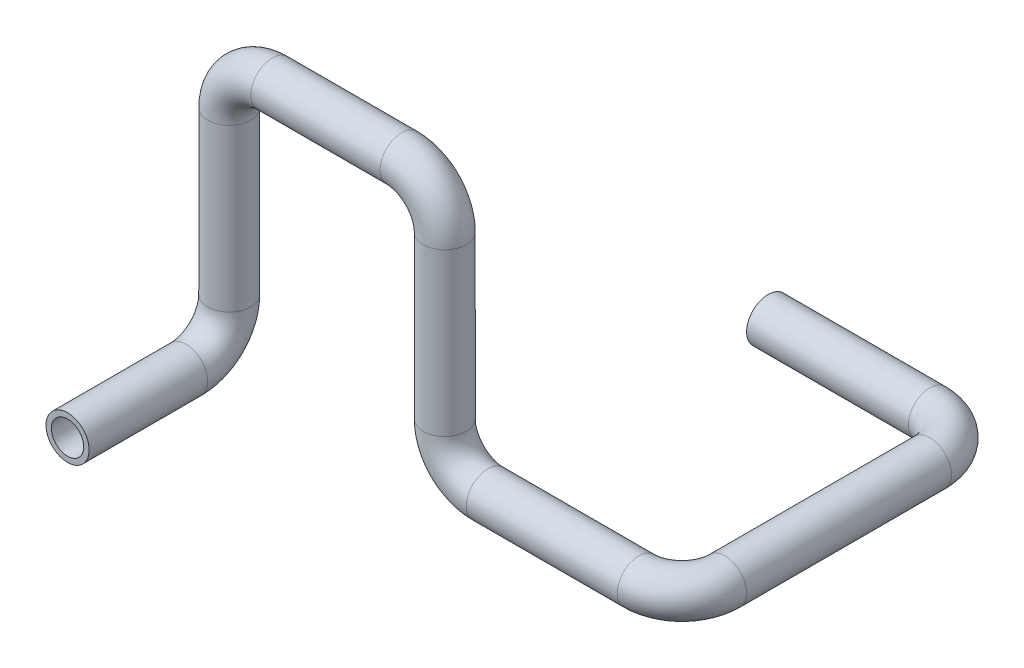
ISO-10303-21;
HEADER;
FILE_DESCRIPTION(('STEP AP214'),'2;1');
FILE_NAME('part.step','',(''),(''),'','','');
FILE_SCHEMA(('AUTOMOTIVE_DESIGN { 1 0 10303 214 1 1 1 1 }'));
ENDSEC;
DATA;
#1=APPLICATION_CONTEXT('core data for automotive mechanical design processes');
#2=APPLICATION_PROTOCOL_DEFINITION('international standard','automotive_design',2000,#1);
#3=PRODUCT_CONTEXT('',#1,'mechanical');
#4=PRODUCT('Part','Part','',(#3));
#5=PRODUCT_RELATED_PRODUCT_CATEGORY('part','',(#4));
#6=PRODUCT_DEFINITION_FORMATION('','',#4);
#7=PRODUCT_DEFINITION_CONTEXT('part definition',#1,'design');
#8=PRODUCT_DEFINITION('design','',#6,#7);
#9=PRODUCT_DEFINITION_SHAPE('','',#8);
#10=(LENGTH_UNIT() NAMED_UNIT(*) SI_UNIT(.MILLI.,.METRE.));
#11=(NAMED_UNIT(*) PLANE_ANGLE_UNIT() SI_UNIT($,.RADIAN.));
#12=(NAMED_UNIT(*) SI_UNIT($,.STERADIAN.) SOLID_ANGLE_UNIT());
#13=UNCERTAINTY_MEASURE_WITH_UNIT(LENGTH_MEASURE(1.E-05),#10,'distance_accuracy_value','');
#14=(GEOMETRIC_REPRESENTATION_CONTEXT(3) GLOBAL_UNCERTAINTY_ASSIGNED_CONTEXT((#13)) GLOBAL_UNIT_ASSIGNED_CONTEXT((#10,
#11,#12)) REPRESENTATION_CONTEXT('',''));
#15=CARTESIAN_POINT('',(0.,0.,0.));
#16=DIRECTION('',(0.,0.,1.));
#17=DIRECTION('',(1.,0.,0.));
#18=AXIS2_PLACEMENT_3D('',#15,#16,#17);
#19=CARTESIAN_POINT('',(0.,0.,0.));
#20=DIRECTION('',(-1.,0.,0.));
#21=DIRECTION('',(0.,1.,0.));
#22=AXIS2_PLACEMENT_3D('',#19,#20,#21);
#23=PLANE('',#22);
#24=CARTESIAN_POINT('',(0.,0.,0.));
#25=DIRECTION('',(-1.,0.,0.));
#26=DIRECTION('',(0.,0.,1.));
#27=AXIS2_PLACEMENT_3D('',#24,#25,#26);
#28=CIRCLE('',#27,7.49999999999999);
#29=CARTESIAN_POINT('',(0.,0.,7.49999999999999));
#30=VERTEX_POINT('',#29);
#31=EDGE_CURVE('E95',#30,#30,#28,.T.);
#32=ORIENTED_EDGE('',*,*,#31,.F.);
#33=EDGE_LOOP('',(#32));
#34=FACE_BOUND('',#33,.T.);
#35=CARTESIAN_POINT('',(0.,0.,0.));
#36=DIRECTION('',(-1.,0.,0.));
#37=DIRECTION('',(0.,1.,0.));
#38=AXIS2_PLACEMENT_3D('',#35,#36,#37);
#39=CIRCLE('',#38,9.99999999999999);
#40=CARTESIAN_POINT('',(0.,9.99999999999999,0.));
#41=VERTEX_POINT('',#40);
#42=EDGE_CURVE('E88',#41,#41,#39,.T.);
#43=ORIENTED_EDGE('',*,*,#42,.T.);
#44=EDGE_LOOP('',(#43));
#45=FACE_BOUND('',#44,.T.);
#46=ADVANCED_FACE('F42',(#34,#45),#23,.T.);
#47=CARTESIAN_POINT('',(-115.,0.,210.));
#48=DIRECTION('',(0.,0.,-1.));
#49=DIRECTION('',(-1.,0.,0.));
#50=AXIS2_PLACEMENT_3D('',#47,#48,#49);
#51=PLANE('',#50);
#52=CARTESIAN_POINT('',(-115.,0.,210.));
#53=DIRECTION('',(0.,0.,-1.));
#54=DIRECTION('',(-1.,0.,0.));
#55=AXIS2_PLACEMENT_3D('',#52,#53,#54);
#56=CIRCLE('',#55,7.49999999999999);
#57=CARTESIAN_POINT('',(-122.5,0.,210.));
#58=VERTEX_POINT('',#57);
#59=EDGE_CURVE('E91',#58,#58,#56,.T.);
#60=ORIENTED_EDGE('',*,*,#59,.T.);
#61=EDGE_LOOP('',(#60));
#62=FACE_BOUND('',#61,.T.);
#63=CARTESIAN_POINT('',(-115.,0.,210.));
#64=DIRECTION('',(0.,0.,-1.));
#65=DIRECTION('',(-1.,0.,0.));
#66=AXIS2_PLACEMENT_3D('',#63,#64,#65);
#67=CIRCLE('',#66,9.99999999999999);
#68=CARTESIAN_POINT('',(-125.,0.,210.));
#69=VERTEX_POINT('',#68);
#70=EDGE_CURVE('E11',#69,#69,#67,.T.);
#71=ORIENTED_EDGE('',*,*,#70,.F.);
#72=EDGE_LOOP('',(#71));
#73=FACE_BOUND('',#72,.T.);
#74=ADVANCED_FACE('F145',(#62,#73),#51,.F.);
#75=CARTESIAN_POINT('',(0.,0.,0.));
#76=DIRECTION('',(1.,0.,0.));
#77=DIRECTION('',(0.,0.,-1.));
#78=AXIS2_PLACEMENT_3D('',#75,#76,#77);
#79=CYLINDRICAL_SURFACE('',#78,9.99999999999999);
#80=CARTESIAN_POINT('',(75.,0.,0.));
#81=DIRECTION('',(-1.,0.,0.));
#82=DIRECTION('',(0.,1.,0.));
#83=AXIS2_PLACEMENT_3D('',#80,#81,#82);
#84=CIRCLE('',#83,9.99999999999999);
#85=CARTESIAN_POINT('',(75.,0.,-10.));
#86=VERTEX_POINT('',#85);
#87=EDGE_CURVE('E85',#86,#86,#84,.T.);
#88=ORIENTED_EDGE('',*,*,#87,.T.);
#89=EDGE_LOOP('',(#88));
#90=FACE_BOUND('',#89,.T.);
#91=ORIENTED_EDGE('',*,*,#42,.F.);
#92=EDGE_LOOP('',(#91));
#93=FACE_BOUND('',#92,.T.);
#94=ADVANCED_FACE('F149',(#90,#93),#79,.T.);
#95=CARTESIAN_POINT('',(75.,0.,20.));
#96=DIRECTION('',(0.,-1.,0.));
#97=DIRECTION('',(0.,0.,-1.));
#98=AXIS2_PLACEMENT_3D('',#95,#96,#97);
#99=TOROIDAL_SURFACE('',#98,20.,9.99999999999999);
#100=CARTESIAN_POINT('',(95.,0.,20.));
#101=DIRECTION('',(0.,0.,-1.));
#102=DIRECTION('',(0.,1.,0.));
#103=AXIS2_PLACEMENT_3D('',#100,#101,#102);
#104=CIRCLE('',#103,9.99999999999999);
#105=CARTESIAN_POINT('',(105.,0.,20.));
#106=VERTEX_POINT('',#105);
#107=EDGE_CURVE('E82',#106,#106,#104,.T.);
#108=CARTESIAN_POINT('',(75.,0.,20.));
#109=DIRECTION('',(0.,-1.,0.));
#110=DIRECTION('',(0.,0.,-1.));
#111=AXIS2_PLACEMENT_3D('',#108,#109,#110);
#112=CIRCLE('',#111,30.);
#113=EDGE_CURVE('',#86,#106,#112,.T.);
#114=ORIENTED_EDGE('',*,*,#87,.F.);
#115=ORIENTED_EDGE('',*,*,#107,.T.);
#116=ORIENTED_EDGE('',*,*,#113,.T.);
#117=ORIENTED_EDGE('',*,*,#113,.F.);
#118=EDGE_LOOP('',(#114,#116,#115,#117));
#119=FACE_BOUND('',#118,.T.);
#120=ADVANCED_FACE('F151',(#119),#99,.T.);
#121=CARTESIAN_POINT('',(95.,0.,20.));
#122=DIRECTION('',(0.,0.,1.));
#123=DIRECTION('',(1.,0.,0.));
#124=AXIS2_PLACEMENT_3D('',#121,#122,#123);
#125=CYLINDRICAL_SURFACE('',#124,9.99999999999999);
#126=CARTESIAN_POINT('',(95.,0.,115.));
#127=DIRECTION('',(0.,0.,-1.));
#128=DIRECTION('',(0.,1.,0.));
#129=AXIS2_PLACEMENT_3D('',#126,#127,#128);
#130=CIRCLE('',#129,9.99999999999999);
#131=CARTESIAN_POINT('',(105.,0.,115.));
#132=VERTEX_POINT('',#131);
#133=EDGE_CURVE('E79',#132,#132,#130,.T.);
#134=ORIENTED_EDGE('',*,*,#133,.T.);
#135=EDGE_LOOP('',(#134));
#136=FACE_BOUND('',#135,.T.);
#137=ORIENTED_EDGE('',*,*,#107,.F.);
#138=EDGE_LOOP('',(#137));
#139=FACE_BOUND('',#138,.T.);
#140=ADVANCED_FACE('F158',(#136,#139),#125,.T.);
#141=CARTESIAN_POINT('',(75.,0.,115.));
#142=DIRECTION('',(0.,-1.,0.));
#143=DIRECTION('',(0.,0.,-1.));
#144=AXIS2_PLACEMENT_3D('',#141,#142,#143);
#145=TOROIDAL_SURFACE('',#144,20.,9.99999999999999);
#146=CARTESIAN_POINT('',(75.,0.,135.));
#147=DIRECTION('',(1.,0.,0.));
#148=DIRECTION('',(0.,1.,0.));
#149=AXIS2_PLACEMENT_3D('',#146,#147,#148);
#150=CIRCLE('',#149,9.99999999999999);
#151=CARTESIAN_POINT('',(75.,0.,145.));
#152=VERTEX_POINT('',#151);
#153=EDGE_CURVE('E76',#152,#152,#150,.T.);
#154=CARTESIAN_POINT('',(75.,0.,115.));
#155=DIRECTION('',(0.,-1.,0.));
#156=DIRECTION('',(0.,0.,-1.));
#157=AXIS2_PLACEMENT_3D('',#154,#155,#156);
#158=CIRCLE('',#157,30.);
#159=EDGE_CURVE('',#132,#152,#158,.T.);
#160=ORIENTED_EDGE('',*,*,#133,.F.);
#161=ORIENTED_EDGE('',*,*,#153,.T.);
#162=ORIENTED_EDGE('',*,*,#159,.T.);
#163=ORIENTED_EDGE('',*,*,#159,.F.);
#164=EDGE_LOOP('',(#160,#162,#161,#163));
#165=FACE_BOUND('',#164,.T.);
#166=ADVANCED_FACE('F199',(#165),#145,.T.);
#167=CARTESIAN_POINT('',(75.,0.,135.));
#168=DIRECTION('',(-1.,0.,0.));
#169=DIRECTION('',(0.,-1.,0.));
#170=AXIS2_PLACEMENT_3D('',#167,#168,#169);
#171=CYLINDRICAL_SURFACE('',#170,9.99999999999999);
#172=CARTESIAN_POINT('',(5.,0.,135.));
#173=DIRECTION('',(1.,0.,0.));
#174=DIRECTION('',(0.,1.,0.));
#175=AXIS2_PLACEMENT_3D('',#172,#173,#174);
#176=CIRCLE('',#175,9.99999999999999);
#177=CARTESIAN_POINT('',(5.,-10.,135.));
#178=VERTEX_POINT('',#177);
#179=EDGE_CURVE('E73',#178,#178,#176,.T.);
#180=ORIENTED_EDGE('',*,*,#179,.T.);
#181=EDGE_LOOP('',(#180));
#182=FACE_BOUND('',#181,.T.);
#183=ORIENTED_EDGE('',*,*,#153,.F.);
#184=EDGE_LOOP('',(#183));
#185=FACE_BOUND('',#184,.T.);
#186=ADVANCED_FACE('F195',(#182,#185),#171,.T.);
#187=CARTESIAN_POINT('',(5.00000000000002,20.,135.));
#188=DIRECTION('',(0.,0.,-1.));
#189=DIRECTION('',(-1.,0.,0.));
#190=AXIS2_PLACEMENT_3D('',#187,#188,#189);
#191=TOROIDAL_SURFACE('',#190,20.,9.99999999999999);
#192=CARTESIAN_POINT('',(-15.,20.,135.));
#193=DIRECTION('',(0.,-1.,0.));
#194=DIRECTION('',(1.,0.,0.));
#195=AXIS2_PLACEMENT_3D('',#192,#193,#194);
#196=CIRCLE('',#195,9.99999999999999);
#197=CARTESIAN_POINT('',(-25.,20.,135.));
#198=VERTEX_POINT('',#197);
#199=EDGE_CURVE('E70',#198,#198,#196,.T.);
#200=CARTESIAN_POINT('',(5.00000000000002,20.,135.));
#201=DIRECTION('',(0.,0.,-1.));
#202=DIRECTION('',(-1.,0.,0.));
#203=AXIS2_PLACEMENT_3D('',#200,#201,#202);
#204=CIRCLE('',#203,30.);
#205=EDGE_CURVE('',#178,#198,#204,.T.);
#206=ORIENTED_EDGE('',*,*,#179,.F.);
#207=ORIENTED_EDGE('',*,*,#199,.T.);
#208=ORIENTED_EDGE('',*,*,#205,.T.);
#209=ORIENTED_EDGE('',*,*,#205,.F.);
#210=EDGE_LOOP('',(#206,#208,#207,#209));
#211=FACE_BOUND('',#210,.T.);
#212=ADVANCED_FACE('F191',(#211),#191,.T.);
#213=CARTESIAN_POINT('',(-15.,20.,135.));
#214=DIRECTION('',(0.,1.,0.));
#215=DIRECTION('',(-1.,0.,0.));
#216=AXIS2_PLACEMENT_3D('',#213,#214,#215);
#217=CYLINDRICAL_SURFACE('',#216,9.99999999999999);
#218=CARTESIAN_POINT('',(-15.,95.,135.));
#219=DIRECTION('',(0.,-1.,0.));
#220=DIRECTION('',(1.,0.,0.));
#221=AXIS2_PLACEMENT_3D('',#218,#219,#220);
#222=CIRCLE('',#221,9.99999999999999);
#223=CARTESIAN_POINT('',(-4.99999999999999,95.,135.));
#224=VERTEX_POINT('',#223);
#225=EDGE_CURVE('E67',#224,#224,#222,.T.);
#226=ORIENTED_EDGE('',*,*,#225,.T.);
#227=EDGE_LOOP('',(#226));
#228=FACE_BOUND('',#227,.T.);
#229=ORIENTED_EDGE('',*,*,#199,.F.);
#230=EDGE_LOOP('',(#229));
#231=FACE_BOUND('',#230,.T.);
#232=ADVANCED_FACE('F187',(#228,#231),#217,.T.);
#233=CARTESIAN_POINT('',(-35.,95.,135.));
#234=DIRECTION('',(0.,0.,1.));
#235=DIRECTION('',(1.,0.,0.));
#236=AXIS2_PLACEMENT_3D('',#233,#234,#235);
#237=TOROIDAL_SURFACE('',#236,20.,9.99999999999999);
#238=CARTESIAN_POINT('',(-35.,115.,135.));
#239=DIRECTION('',(1.,0.,0.));
#240=DIRECTION('',(0.,1.,0.));
#241=AXIS2_PLACEMENT_3D('',#238,#239,#240);
#242=CIRCLE('',#241,9.99999999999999);
#243=CARTESIAN_POINT('',(-35.,125.,135.));
#244=VERTEX_POINT('',#243);
#245=EDGE_CURVE('E64',#244,#244,#242,.T.);
#246=CARTESIAN_POINT('',(-35.,95.,135.));
#247=DIRECTION('',(0.,0.,1.));
#248=DIRECTION('',(1.,0.,0.));
#249=AXIS2_PLACEMENT_3D('',#246,#247,#248);
#250=CIRCLE('',#249,30.);
#251=EDGE_CURVE('',#224,#244,#250,.T.);
#252=ORIENTED_EDGE('',*,*,#225,.F.);
#253=ORIENTED_EDGE('',*,*,#245,.T.);
#254=ORIENTED_EDGE('',*,*,#251,.T.);
#255=ORIENTED_EDGE('',*,*,#251,.F.);
#256=EDGE_LOOP('',(#252,#254,#253,#255));
#257=FACE_BOUND('',#256,.T.);
#258=ADVANCED_FACE('F183',(#257),#237,.T.);
#259=CARTESIAN_POINT('',(-35.,115.,135.));
#260=DIRECTION('',(-1.,0.,0.));
#261=DIRECTION('',(0.,0.,1.));
#262=AXIS2_PLACEMENT_3D('',#259,#260,#261);
#263=CYLINDRICAL_SURFACE('',#262,9.99999999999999);
#264=CARTESIAN_POINT('',(-95.,115.,135.));
#265=DIRECTION('',(1.,0.,0.));
#266=DIRECTION('',(0.,1.,0.));
#267=AXIS2_PLACEMENT_3D('',#264,#265,#266);
#268=CIRCLE('',#267,9.99999999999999);
#269=CARTESIAN_POINT('',(-95.,125.,135.));
#270=VERTEX_POINT('',#269);
#271=EDGE_CURVE('E61',#270,#270,#268,.T.);
#272=ORIENTED_EDGE('',*,*,#271,.T.);
#273=EDGE_LOOP('',(#272));
#274=FACE_BOUND('',#273,.T.);
#275=ORIENTED_EDGE('',*,*,#245,.F.);
#276=EDGE_LOOP('',(#275));
#277=FACE_BOUND('',#276,.T.);
#278=ADVANCED_FACE('F179',(#274,#277),#263,.T.);
#279=CARTESIAN_POINT('',(-95.,95.,135.));
#280=DIRECTION('',(0.,0.,1.));
#281=DIRECTION('',(1.,0.,0.));
#282=AXIS2_PLACEMENT_3D('',#279,#280,#281);
#283=TOROIDAL_SURFACE('',#282,20.,9.99999999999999);
#284=CARTESIAN_POINT('',(-115.,95.,135.));
#285=DIRECTION('',(0.,1.,0.));
#286=DIRECTION('',(-1.,0.,0.));
#287=AXIS2_PLACEMENT_3D('',#284,#285,#286);
#288=CIRCLE('',#287,9.99999999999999);
#289=CARTESIAN_POINT('',(-125.,95.,135.));
#290=VERTEX_POINT('',#289);
#291=EDGE_CURVE('E56',#290,#290,#288,.T.);
#292=CARTESIAN_POINT('',(-95.,95.,135.));
#293=DIRECTION('',(0.,0.,1.));
#294=DIRECTION('',(1.,0.,0.));
#295=AXIS2_PLACEMENT_3D('',#292,#293,#294);
#296=CIRCLE('',#295,30.);
#297=EDGE_CURVE('',#270,#290,#296,.T.);
#298=ORIENTED_EDGE('',*,*,#271,.F.);
#299=ORIENTED_EDGE('',*,*,#291,.T.);
#300=ORIENTED_EDGE('',*,*,#297,.T.);
#301=ORIENTED_EDGE('',*,*,#297,.F.);
#302=EDGE_LOOP('',(#298,#300,#299,#301));
#303=FACE_BOUND('',#302,.T.);
#304=ADVANCED_FACE('F175',(#303),#283,.T.);
#305=CARTESIAN_POINT('',(-115.,95.,135.));
#306=DIRECTION('',(0.,-1.,0.));
#307=DIRECTION('',(1.,0.,0.));
#308=AXIS2_PLACEMENT_3D('',#305,#306,#307);
#309=CYLINDRICAL_SURFACE('',#308,9.99999999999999);
#310=CARTESIAN_POINT('',(-115.,20.,135.));
#311=DIRECTION('',(0.,1.,0.));
#312=DIRECTION('',(-1.,0.,0.));
#313=AXIS2_PLACEMENT_3D('',#310,#311,#312);
#314=CIRCLE('',#313,9.99999999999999);
#315=CARTESIAN_POINT('',(-115.,20.,125.));
#316=VERTEX_POINT('',#315);
#317=EDGE_CURVE('E52',#316,#316,#314,.T.);
#318=ORIENTED_EDGE('',*,*,#317,.T.);
#319=EDGE_LOOP('',(#318));
#320=FACE_BOUND('',#319,.T.);
#321=ORIENTED_EDGE('',*,*,#291,.F.);
#322=EDGE_LOOP('',(#321));
#323=FACE_BOUND('',#322,.T.);
#324=ADVANCED_FACE('F169',(#320,#323),#309,.T.);
#325=CARTESIAN_POINT('',(-115.,20.,155.));
#326=DIRECTION('',(-1.,0.,0.));
#327=DIRECTION('',(0.,0.,1.));
#328=AXIS2_PLACEMENT_3D('',#325,#326,#327);
#329=TOROIDAL_SURFACE('',#328,20.,9.99999999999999);
#330=CARTESIAN_POINT('',(-115.,-3.12250225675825E-13,155.));
#331=DIRECTION('',(0.,0.,-1.));
#332=DIRECTION('',(-1.,0.,0.));
#333=AXIS2_PLACEMENT_3D('',#330,#331,#332);
#334=CIRCLE('',#333,9.99999999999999);
#335=CARTESIAN_POINT('',(-115.,-10.,155.));
#336=VERTEX_POINT('',#335);
#337=EDGE_CURVE('E48',#336,#336,#334,.T.);
#338=CARTESIAN_POINT('',(-115.,20.,155.));
#339=DIRECTION('',(-1.,0.,0.));
#340=DIRECTION('',(0.,0.,1.));
#341=AXIS2_PLACEMENT_3D('',#338,#339,#340);
#342=CIRCLE('',#341,30.);
#343=EDGE_CURVE('',#316,#336,#342,.T.);
#344=ORIENTED_EDGE('',*,*,#317,.F.);
#345=ORIENTED_EDGE('',*,*,#337,.T.);
#346=ORIENTED_EDGE('',*,*,#343,.T.);
#347=ORIENTED_EDGE('',*,*,#343,.F.);
#348=EDGE_LOOP('',(#344,#346,#345,#347));
#349=FACE_BOUND('',#348,.T.);
#350=ADVANCED_FACE('F164',(#349),#329,.T.);
#351=CARTESIAN_POINT('',(-115.,0.,155.));
#352=DIRECTION('',(0.,0.,1.));
#353=DIRECTION('',(1.,0.,0.));
#354=AXIS2_PLACEMENT_3D('',#351,#352,#353);
#355=CYLINDRICAL_SURFACE('',#354,9.99999999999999);
#356=ORIENTED_EDGE('',*,*,#70,.T.);
#357=EDGE_LOOP('',(#356));
#358=FACE_BOUND('',#357,.T.);
#359=ORIENTED_EDGE('',*,*,#337,.F.);
#360=EDGE_LOOP('',(#359));
#361=FACE_BOUND('',#360,.T.);
#362=ADVANCED_FACE('F139',(#358,#361),#355,.T.);
#363=CARTESIAN_POINT('',(0.,0.,0.));
#364=DIRECTION('',(1.,0.,0.));
#365=DIRECTION('',(0.,0.,-1.));
#366=AXIS2_PLACEMENT_3D('',#363,#364,#365);
#367=CYLINDRICAL_SURFACE('',#366,7.49999999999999);
#368=CARTESIAN_POINT('',(75.,0.,0.));
#369=DIRECTION('',(1.,0.,0.));
#370=DIRECTION('',(0.,0.,-1.));
#371=AXIS2_PLACEMENT_3D('',#368,#369,#370);
#372=CIRCLE('',#371,7.49999999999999);
#373=CARTESIAN_POINT('',(75.,0.,-7.5));
#374=VERTEX_POINT('',#373);
#375=EDGE_CURVE('E98',#374,#374,#372,.F.);
#376=ORIENTED_EDGE('',*,*,#375,.F.);
#377=EDGE_LOOP('',(#376));
#378=FACE_BOUND('',#377,.T.);
#379=ORIENTED_EDGE('',*,*,#31,.T.);
#380=EDGE_LOOP('',(#379));
#381=FACE_BOUND('',#380,.T.);
#382=ADVANCED_FACE('F136',(#378,#381),#367,.F.);
#383=CARTESIAN_POINT('',(75.,0.,20.));
#384=DIRECTION('',(0.,-1.,0.));
#385=DIRECTION('',(0.,0.,-1.));
#386=AXIS2_PLACEMENT_3D('',#383,#384,#385);
#387=TOROIDAL_SURFACE('',#386,20.,7.49999999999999);
#388=CARTESIAN_POINT('',(95.,0.,20.));
#389=DIRECTION('',(0.,0.,-1.));
#390=DIRECTION('',(-1.,0.,0.));
#391=AXIS2_PLACEMENT_3D('',#388,#389,#390);
#392=CIRCLE('',#391,7.49999999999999);
#393=CARTESIAN_POINT('',(102.5,0.,20.));
#394=VERTEX_POINT('',#393);
#395=EDGE_CURVE('E128',#394,#394,#392,.T.);
#396=CARTESIAN_POINT('',(75.,0.,20.));
#397=DIRECTION('',(0.,-1.,0.));
#398=DIRECTION('',(0.,0.,-1.));
#399=AXIS2_PLACEMENT_3D('',#396,#397,#398);
#400=CIRCLE('',#399,27.5);
#401=EDGE_CURVE('',#374,#394,#400,.T.);
#402=ORIENTED_EDGE('',*,*,#375,.T.);
#403=ORIENTED_EDGE('',*,*,#395,.F.);
#404=ORIENTED_EDGE('',*,*,#401,.T.);
#405=ORIENTED_EDGE('',*,*,#401,.F.);
#406=EDGE_LOOP('',(#402,#404,#403,#405));
#407=FACE_BOUND('',#406,.T.);
#408=ADVANCED_FACE('F134',(#407),#387,.F.);
#409=CARTESIAN_POINT('',(95.,0.,20.));
#410=DIRECTION('',(0.,0.,1.));
#411=DIRECTION('',(1.,0.,0.));
#412=AXIS2_PLACEMENT_3D('',#409,#410,#411);
#413=CYLINDRICAL_SURFACE('',#412,7.49999999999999);
#414=CARTESIAN_POINT('',(95.,0.,115.));
#415=DIRECTION('',(0.,0.,1.));
#416=DIRECTION('',(1.,0.,0.));
#417=AXIS2_PLACEMENT_3D('',#414,#415,#416);
#418=CIRCLE('',#417,7.49999999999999);
#419=CARTESIAN_POINT('',(102.5,0.,115.));
#420=VERTEX_POINT('',#419);
#421=EDGE_CURVE('E125',#420,#420,#418,.F.);
#422=ORIENTED_EDGE('',*,*,#421,.F.);
#423=EDGE_LOOP('',(#422));
#424=FACE_BOUND('',#423,.T.);
#425=ORIENTED_EDGE('',*,*,#395,.T.);
#426=EDGE_LOOP('',(#425));
#427=FACE_BOUND('',#426,.T.);
#428=ADVANCED_FACE('F271',(#424,#427),#413,.F.);
#429=CARTESIAN_POINT('',(75.,0.,115.));
#430=DIRECTION('',(0.,-1.,0.));
#431=DIRECTION('',(0.,0.,-1.));
#432=AXIS2_PLACEMENT_3D('',#429,#430,#431);
#433=TOROIDAL_SURFACE('',#432,20.,7.49999999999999);
#434=CARTESIAN_POINT('',(75.,0.,135.));
#435=DIRECTION('',(1.,0.,0.));
#436=DIRECTION('',(0.,0.,-1.));
#437=AXIS2_PLACEMENT_3D('',#434,#435,#436);
#438=CIRCLE('',#437,7.49999999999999);
#439=CARTESIAN_POINT('',(75.,0.,142.5));
#440=VERTEX_POINT('',#439);
#441=EDGE_CURVE('E122',#440,#440,#438,.T.);
#442=CARTESIAN_POINT('',(75.,0.,115.));
#443=DIRECTION('',(0.,-1.,0.));
#444=DIRECTION('',(0.,0.,-1.));
#445=AXIS2_PLACEMENT_3D('',#442,#443,#444);
#446=CIRCLE('',#445,27.5);
#447=EDGE_CURVE('',#420,#440,#446,.T.);
#448=ORIENTED_EDGE('',*,*,#421,.T.);
#449=ORIENTED_EDGE('',*,*,#441,.F.);
#450=ORIENTED_EDGE('',*,*,#447,.T.);
#451=ORIENTED_EDGE('',*,*,#447,.F.);
#452=EDGE_LOOP('',(#448,#450,#449,#451));
#453=FACE_BOUND('',#452,.T.);
#454=ADVANCED_FACE('F281',(#453),#433,.F.);
#455=CARTESIAN_POINT('',(75.,0.,135.));
#456=DIRECTION('',(-1.,0.,0.));
#457=DIRECTION('',(0.,-1.,0.));
#458=AXIS2_PLACEMENT_3D('',#455,#456,#457);
#459=CYLINDRICAL_SURFACE('',#458,7.49999999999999);
#460=CARTESIAN_POINT('',(5.,0.,135.));
#461=DIRECTION('',(-1.,0.,0.));
#462=DIRECTION('',(0.,-1.,0.));
#463=AXIS2_PLACEMENT_3D('',#460,#461,#462);
#464=CIRCLE('',#463,7.49999999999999);
#465=CARTESIAN_POINT('',(5.,-7.50000000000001,135.));
#466=VERTEX_POINT('',#465);
#467=EDGE_CURVE('E119',#466,#466,#464,.F.);
#468=ORIENTED_EDGE('',*,*,#467,.F.);
#469=EDGE_LOOP('',(#468));
#470=FACE_BOUND('',#469,.T.);
#471=ORIENTED_EDGE('',*,*,#441,.T.);
#472=EDGE_LOOP('',(#471));
#473=FACE_BOUND('',#472,.T.);
#474=ADVANCED_FACE('F291',(#470,#473),#459,.F.);
#475=CARTESIAN_POINT('',(5.00000000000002,20.,135.));
#476=DIRECTION('',(0.,0.,-1.));
#477=DIRECTION('',(-1.,0.,0.));
#478=AXIS2_PLACEMENT_3D('',#475,#476,#477);
#479=TOROIDAL_SURFACE('',#478,20.,7.49999999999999);
#480=CARTESIAN_POINT('',(-15.,20.,135.));
#481=DIRECTION('',(0.,-1.,0.));
#482=DIRECTION('',(1.,0.,0.));
#483=AXIS2_PLACEMENT_3D('',#480,#481,#482);
#484=CIRCLE('',#483,7.49999999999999);
#485=CARTESIAN_POINT('',(-22.5,20.,135.));
#486=VERTEX_POINT('',#485);
#487=EDGE_CURVE('E116',#486,#486,#484,.T.);
#488=CARTESIAN_POINT('',(5.00000000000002,20.,135.));
#489=DIRECTION('',(0.,0.,-1.));
#490=DIRECTION('',(-1.,0.,0.));
#491=AXIS2_PLACEMENT_3D('',#488,#489,#490);
#492=CIRCLE('',#491,27.5);
#493=EDGE_CURVE('',#466,#486,#492,.T.);
#494=ORIENTED_EDGE('',*,*,#467,.T.);
#495=ORIENTED_EDGE('',*,*,#487,.F.);
#496=ORIENTED_EDGE('',*,*,#493,.T.);
#497=ORIENTED_EDGE('',*,*,#493,.F.);
#498=EDGE_LOOP('',(#494,#496,#495,#497));
#499=FACE_BOUND('',#498,.T.);
#500=ADVANCED_FACE('F301',(#499),#479,.F.);
#501=CARTESIAN_POINT('',(-15.,20.,135.));
#502=DIRECTION('',(0.,1.,0.));
#503=DIRECTION('',(-1.,0.,0.));
#504=AXIS2_PLACEMENT_3D('',#501,#502,#503);
#505=CYLINDRICAL_SURFACE('',#504,7.49999999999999);
#506=CARTESIAN_POINT('',(-15.,95.,135.));
#507=DIRECTION('',(0.,1.,0.));
#508=DIRECTION('',(-1.,0.,0.));
#509=AXIS2_PLACEMENT_3D('',#506,#507,#508);
#510=CIRCLE('',#509,7.49999999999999);
#511=CARTESIAN_POINT('',(-7.49999999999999,95.,135.));
#512=VERTEX_POINT('',#511);
#513=EDGE_CURVE('E113',#512,#512,#510,.F.);
#514=ORIENTED_EDGE('',*,*,#513,.F.);
#515=EDGE_LOOP('',(#514));
#516=FACE_BOUND('',#515,.T.);
#517=ORIENTED_EDGE('',*,*,#487,.T.);
#518=EDGE_LOOP('',(#517));
#519=FACE_BOUND('',#518,.T.);
#520=ADVANCED_FACE('F311',(#516,#519),#505,.F.);
#521=CARTESIAN_POINT('',(-35.,95.,135.));
#522=DIRECTION('',(0.,0.,1.));
#523=DIRECTION('',(1.,0.,0.));
#524=AXIS2_PLACEMENT_3D('',#521,#522,#523);
#525=TOROIDAL_SURFACE('',#524,20.,7.49999999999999);
#526=CARTESIAN_POINT('',(-35.,115.,135.));
#527=DIRECTION('',(1.,0.,0.));
#528=DIRECTION('',(0.,1.,0.));
#529=AXIS2_PLACEMENT_3D('',#526,#527,#528);
#530=CIRCLE('',#529,7.49999999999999);
#531=CARTESIAN_POINT('',(-35.,122.5,135.));
#532=VERTEX_POINT('',#531);
#533=EDGE_CURVE('E110',#532,#532,#530,.T.);
#534=CARTESIAN_POINT('',(-35.,95.,135.));
#535=DIRECTION('',(0.,0.,1.));
#536=DIRECTION('',(1.,0.,0.));
#537=AXIS2_PLACEMENT_3D('',#534,#535,#536);
#538=CIRCLE('',#537,27.5);
#539=EDGE_CURVE('',#512,#532,#538,.T.);
#540=ORIENTED_EDGE('',*,*,#513,.T.);
#541=ORIENTED_EDGE('',*,*,#533,.F.);
#542=ORIENTED_EDGE('',*,*,#539,.T.);
#543=ORIENTED_EDGE('',*,*,#539,.F.);
#544=EDGE_LOOP('',(#540,#542,#541,#543));
#545=FACE_BOUND('',#544,.T.);
#546=ADVANCED_FACE('F321',(#545),#525,.F.);
#547=CARTESIAN_POINT('',(-35.,115.,135.));
#548=DIRECTION('',(-1.,0.,0.));
#549=DIRECTION('',(0.,0.,1.));
#550=AXIS2_PLACEMENT_3D('',#547,#548,#549);
#551=CYLINDRICAL_SURFACE('',#550,7.49999999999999);
#552=CARTESIAN_POINT('',(-95.,115.,135.));
#553=DIRECTION('',(-1.,0.,0.));
#554=DIRECTION('',(0.,0.,1.));
#555=AXIS2_PLACEMENT_3D('',#552,#553,#554);
#556=CIRCLE('',#555,7.49999999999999);
#557=CARTESIAN_POINT('',(-95.,122.5,135.));
#558=VERTEX_POINT('',#557);
#559=EDGE_CURVE('E107',#558,#558,#556,.F.);
#560=ORIENTED_EDGE('',*,*,#559,.F.);
#561=EDGE_LOOP('',(#560));
#562=FACE_BOUND('',#561,.T.);
#563=ORIENTED_EDGE('',*,*,#533,.T.);
#564=EDGE_LOOP('',(#563));
#565=FACE_BOUND('',#564,.T.);
#566=ADVANCED_FACE('F331',(#562,#565),#551,.F.);
#567=CARTESIAN_POINT('',(-95.,95.,135.));
#568=DIRECTION('',(0.,0.,1.));
#569=DIRECTION('',(1.,0.,0.));
#570=AXIS2_PLACEMENT_3D('',#567,#568,#569);
#571=TOROIDAL_SURFACE('',#570,20.,7.49999999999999);
#572=CARTESIAN_POINT('',(-115.,95.,135.));
#573=DIRECTION('',(0.,1.,0.));
#574=DIRECTION('',(-1.,0.,0.));
#575=AXIS2_PLACEMENT_3D('',#572,#573,#574);
#576=CIRCLE('',#575,7.49999999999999);
#577=CARTESIAN_POINT('',(-122.5,94.9999999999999,135.));
#578=VERTEX_POINT('',#577);
#579=EDGE_CURVE('E104',#578,#578,#576,.T.);
#580=CARTESIAN_POINT('',(-95.,95.,135.));
#581=DIRECTION('',(0.,0.,1.));
#582=DIRECTION('',(1.,0.,0.));
#583=AXIS2_PLACEMENT_3D('',#580,#581,#582);
#584=CIRCLE('',#583,27.5);
#585=EDGE_CURVE('',#558,#578,#584,.T.);
#586=ORIENTED_EDGE('',*,*,#559,.T.);
#587=ORIENTED_EDGE('',*,*,#579,.F.);
#588=ORIENTED_EDGE('',*,*,#585,.T.);
#589=ORIENTED_EDGE('',*,*,#585,.F.);
#590=EDGE_LOOP('',(#586,#588,#587,#589));
#591=FACE_BOUND('',#590,.T.);
#592=ADVANCED_FACE('F341',(#591),#571,.F.);
#593=CARTESIAN_POINT('',(-115.,95.,135.));
#594=DIRECTION('',(0.,-1.,0.));
#595=DIRECTION('',(1.,0.,0.));
#596=AXIS2_PLACEMENT_3D('',#593,#594,#595);
#597=CYLINDRICAL_SURFACE('',#596,7.49999999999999);
#598=CARTESIAN_POINT('',(-115.,20.,135.));
#599=DIRECTION('',(0.,-1.,0.));
#600=DIRECTION('',(1.,0.,0.));
#601=AXIS2_PLACEMENT_3D('',#598,#599,#600);
#602=CIRCLE('',#601,7.49999999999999);
#603=CARTESIAN_POINT('',(-115.,20.,127.5));
#604=VERTEX_POINT('',#603);
#605=EDGE_CURVE('E101',#604,#604,#602,.F.);
#606=ORIENTED_EDGE('',*,*,#605,.F.);
#607=EDGE_LOOP('',(#606));
#608=FACE_BOUND('',#607,.T.);
#609=ORIENTED_EDGE('',*,*,#579,.T.);
#610=EDGE_LOOP('',(#609));
#611=FACE_BOUND('',#610,.T.);
#612=ADVANCED_FACE('F351',(#608,#611),#597,.F.);
#613=CARTESIAN_POINT('',(-115.,20.,155.));
#614=DIRECTION('',(-1.,0.,0.));
#615=DIRECTION('',(0.,0.,1.));
#616=AXIS2_PLACEMENT_3D('',#613,#614,#615);
#617=TOROIDAL_SURFACE('',#616,20.,7.49999999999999);
#618=CARTESIAN_POINT('',(-115.,0.,155.));
#619=DIRECTION('',(0.,0.,-1.));
#620=DIRECTION('',(0.,1.,0.));
#621=AXIS2_PLACEMENT_3D('',#618,#619,#620);
#622=CIRCLE('',#621,7.49999999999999);
#623=CARTESIAN_POINT('',(-115.,-7.50000000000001,155.));
#624=VERTEX_POINT('',#623);
#625=EDGE_CURVE('E94',#624,#624,#622,.T.);
#626=CARTESIAN_POINT('',(-115.,20.,155.));
#627=DIRECTION('',(-1.,0.,0.));
#628=DIRECTION('',(0.,0.,1.));
#629=AXIS2_PLACEMENT_3D('',#626,#627,#628);
#630=CIRCLE('',#629,27.5);
#631=EDGE_CURVE('',#604,#624,#630,.T.);
#632=ORIENTED_EDGE('',*,*,#605,.T.);
#633=ORIENTED_EDGE('',*,*,#625,.F.);
#634=ORIENTED_EDGE('',*,*,#631,.T.);
#635=ORIENTED_EDGE('',*,*,#631,.F.);
#636=EDGE_LOOP('',(#632,#634,#633,#635));
#637=FACE_BOUND('',#636,.T.);
#638=ADVANCED_FACE('F361',(#637),#617,.F.);
#639=CARTESIAN_POINT('',(-115.,0.,155.));
#640=DIRECTION('',(0.,0.,1.));
#641=DIRECTION('',(1.,0.,0.));
#642=AXIS2_PLACEMENT_3D('',#639,#640,#641);
#643=CYLINDRICAL_SURFACE('',#642,7.49999999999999);
#644=ORIENTED_EDGE('',*,*,#59,.F.);
#645=EDGE_LOOP('',(#644));
#646=FACE_BOUND('',#645,.T.);
#647=ORIENTED_EDGE('',*,*,#625,.T.);
#648=EDGE_LOOP('',(#647));
#649=FACE_BOUND('',#648,.T.);
#650=ADVANCED_FACE('F146',(#646,#649),#643,.F.);
#651=CLOSED_SHELL('',(#46,#74,#94,#120,#140,#166,#186,#212,#232,#258,#278,#304,#324,#350,#362,
#382,#408,#428,#454,#474,#500,#520,#546,#566,#592,#612,#638,#650));
#652=MANIFOLD_SOLID_BREP('B2',#651);
#653=ADVANCED_BREP_SHAPE_REPRESENTATION('',(#18,#652),#14);
#654=SHAPE_DEFINITION_REPRESENTATION(#9,#653);
ENDSEC;
END-ISO-10303-21;
